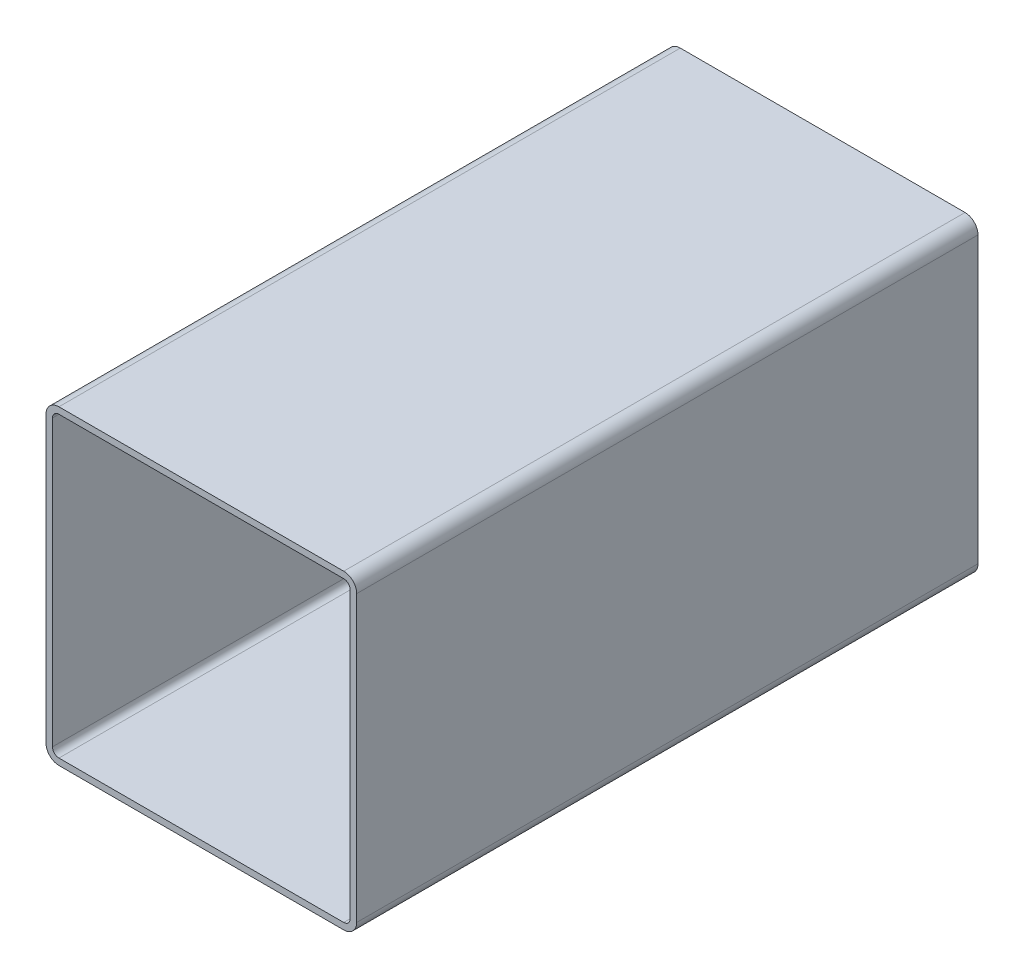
ISO-10303-21;
HEADER;
FILE_DESCRIPTION(('STEP AP214'),'2;1');
FILE_NAME('part.step','',(''),(''),'','','');
FILE_SCHEMA(('AUTOMOTIVE_DESIGN { 1 0 10303 214 1 1 1 1 }'));
ENDSEC;
DATA;
#1=APPLICATION_CONTEXT('core data for automotive mechanical design processes');
#2=APPLICATION_PROTOCOL_DEFINITION('international standard','automotive_design',2000,#1);
#3=PRODUCT_CONTEXT('',#1,'mechanical');
#4=PRODUCT('Part','Part','',(#3));
#5=PRODUCT_RELATED_PRODUCT_CATEGORY('part','',(#4));
#6=PRODUCT_DEFINITION_FORMATION('','',#4);
#7=PRODUCT_DEFINITION_CONTEXT('part definition',#1,'design');
#8=PRODUCT_DEFINITION('design','',#6,#7);
#9=PRODUCT_DEFINITION_SHAPE('','',#8);
#10=(LENGTH_UNIT() NAMED_UNIT(*) SI_UNIT(.MILLI.,.METRE.));
#11=(NAMED_UNIT(*) PLANE_ANGLE_UNIT() SI_UNIT($,.RADIAN.));
#12=(NAMED_UNIT(*) SI_UNIT($,.STERADIAN.) SOLID_ANGLE_UNIT());
#13=UNCERTAINTY_MEASURE_WITH_UNIT(LENGTH_MEASURE(1.E-05),#10,'distance_accuracy_value','');
#14=(GEOMETRIC_REPRESENTATION_CONTEXT(3) GLOBAL_UNCERTAINTY_ASSIGNED_CONTEXT((#13)) GLOBAL_UNIT_ASSIGNED_CONTEXT((#10,
#11,#12)) REPRESENTATION_CONTEXT('',''));
#15=CARTESIAN_POINT('',(0.,0.,0.));
#16=DIRECTION('',(0.,0.,1.));
#17=DIRECTION('',(1.,0.,0.));
#18=AXIS2_PLACEMENT_3D('',#15,#16,#17);
#19=CARTESIAN_POINT('',(6.39730139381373,148.061948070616,304.8));
#20=DIRECTION('',(0.,0.,1.));
#21=DIRECTION('',(1.,0.,0.));
#22=AXIS2_PLACEMENT_3D('',#19,#20,#21);
#23=PLANE('',#22);
#24=CARTESIAN_POINT('',(6.39730139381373,148.061948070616,304.8));
#25=DIRECTION('',(0.,0.,1.));
#26=DIRECTION('',(1.,0.,0.));
#27=AXIS2_PLACEMENT_3D('',#24,#25,#26);
#28=CIRCLE('',#27,6.35);
#29=CARTESIAN_POINT('',(6.39730139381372,154.411948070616,304.8));
#30=VERTEX_POINT('',#29);
#31=CARTESIAN_POINT('',(0.0473013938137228,148.061948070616,304.8));
#32=VERTEX_POINT('',#31);
#33=EDGE_CURVE('E211',#30,#32,#28,.T.);
#34=ORIENTED_EDGE('',*,*,#33,.T.);
#35=DIRECTION('',(0.,-1.,0.));
#36=VECTOR('',#35,1.);
#37=CARTESIAN_POINT('',(0.0473013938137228,8.36194807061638,304.8));
#38=LINE('',#37,#36);
#39=CARTESIAN_POINT('',(0.0473013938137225,8.36194807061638,304.8));
#40=VERTEX_POINT('',#39);
#41=EDGE_CURVE('E214',#32,#40,#38,.T.);
#42=ORIENTED_EDGE('',*,*,#41,.T.);
#43=CARTESIAN_POINT('',(6.39730139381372,8.36194807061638,304.8));
#44=DIRECTION('',(0.,0.,1.));
#45=DIRECTION('',(1.,0.,0.));
#46=AXIS2_PLACEMENT_3D('',#43,#44,#45);
#47=CIRCLE('',#46,6.35);
#48=CARTESIAN_POINT('',(6.39730139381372,2.01194807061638,304.8));
#49=VERTEX_POINT('',#48);
#50=EDGE_CURVE('E217',#40,#49,#47,.T.);
#51=ORIENTED_EDGE('',*,*,#50,.T.);
#52=DIRECTION('',(1.,0.,0.));
#53=VECTOR('',#52,1.);
#54=CARTESIAN_POINT('',(146.097301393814,2.01194807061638,304.8));
#55=LINE('',#54,#53);
#56=CARTESIAN_POINT('',(146.097301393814,2.01194807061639,304.8));
#57=VERTEX_POINT('',#56);
#58=EDGE_CURVE('E219',#49,#57,#55,.T.);
#59=ORIENTED_EDGE('',*,*,#58,.T.);
#60=CARTESIAN_POINT('',(146.097301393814,8.36194807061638,304.8));
#61=DIRECTION('',(0.,0.,1.));
#62=DIRECTION('',(1.,0.,0.));
#63=AXIS2_PLACEMENT_3D('',#60,#61,#62);
#64=CIRCLE('',#63,6.35);
#65=CARTESIAN_POINT('',(152.447301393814,8.36194807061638,304.8));
#66=VERTEX_POINT('',#65);
#67=EDGE_CURVE('E221',#57,#66,#64,.T.);
#68=ORIENTED_EDGE('',*,*,#67,.T.);
#69=DIRECTION('',(0.,1.,0.));
#70=VECTOR('',#69,1.);
#71=CARTESIAN_POINT('',(152.447301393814,148.061948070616,304.8));
#72=LINE('',#71,#70);
#73=CARTESIAN_POINT('',(152.447301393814,148.061948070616,304.8));
#74=VERTEX_POINT('',#73);
#75=EDGE_CURVE('E223',#66,#74,#72,.T.);
#76=ORIENTED_EDGE('',*,*,#75,.T.);
#77=CARTESIAN_POINT('',(146.097301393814,148.061948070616,304.8));
#78=DIRECTION('',(0.,0.,1.));
#79=DIRECTION('',(1.,0.,0.));
#80=AXIS2_PLACEMENT_3D('',#77,#78,#79);
#81=CIRCLE('',#80,6.34999999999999);
#82=CARTESIAN_POINT('',(146.097301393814,154.411948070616,304.8));
#83=VERTEX_POINT('',#82);
#84=EDGE_CURVE('E225',#74,#83,#81,.T.);
#85=ORIENTED_EDGE('',*,*,#84,.T.);
#86=DIRECTION('',(-1.,0.,0.));
#87=VECTOR('',#86,1.);
#88=CARTESIAN_POINT('',(6.39730139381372,154.411948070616,304.8));
#89=LINE('',#88,#87);
#90=EDGE_CURVE('E227',#83,#30,#89,.T.);
#91=ORIENTED_EDGE('',*,*,#90,.T.);
#92=EDGE_LOOP('',(#34,#42,#51,#59,#68,#76,#85,#91));
#93=FACE_BOUND('',#92,.T.);
#94=DIRECTION('',(0.,-1.,0.));
#95=VECTOR('',#94,1.);
#96=CARTESIAN_POINT('',(3.22230139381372,8.36194807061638,304.8));
#97=LINE('',#96,#95);
#98=CARTESIAN_POINT('',(3.22230139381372,148.061948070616,304.8));
#99=VERTEX_POINT('',#98);
#100=CARTESIAN_POINT('',(3.22230139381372,8.36194807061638,304.8));
#101=VERTEX_POINT('',#100);
#102=EDGE_CURVE('E154',#99,#101,#97,.T.);
#103=ORIENTED_EDGE('',*,*,#102,.F.);
#104=CARTESIAN_POINT('',(6.39730139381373,148.061948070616,304.8));
#105=DIRECTION('',(0.,0.,1.));
#106=DIRECTION('',(1.,0.,0.));
#107=AXIS2_PLACEMENT_3D('',#104,#105,#106);
#108=CIRCLE('',#107,3.17500000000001);
#109=CARTESIAN_POINT('',(6.39730139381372,151.236948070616,304.8));
#110=VERTEX_POINT('',#109);
#111=EDGE_CURVE('E146',#110,#99,#108,.T.);
#112=ORIENTED_EDGE('',*,*,#111,.F.);
#113=DIRECTION('',(-1.,0.,0.));
#114=VECTOR('',#113,1.);
#115=CARTESIAN_POINT('',(6.39730139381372,151.236948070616,304.8));
#116=LINE('',#115,#114);
#117=CARTESIAN_POINT('',(146.097301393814,151.236948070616,304.8));
#118=VERTEX_POINT('',#117);
#119=EDGE_CURVE('E179',#118,#110,#116,.T.);
#120=ORIENTED_EDGE('',*,*,#119,.F.);
#121=CARTESIAN_POINT('',(146.097301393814,148.061948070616,304.8));
#122=DIRECTION('',(0.,0.,1.));
#123=DIRECTION('',(1.,0.,0.));
#124=AXIS2_PLACEMENT_3D('',#121,#122,#123);
#125=CIRCLE('',#124,3.17500000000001);
#126=CARTESIAN_POINT('',(149.272301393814,148.061948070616,304.8));
#127=VERTEX_POINT('',#126);
#128=EDGE_CURVE('E177',#127,#118,#125,.T.);
#129=ORIENTED_EDGE('',*,*,#128,.F.);
#130=DIRECTION('',(0.,1.,0.));
#131=VECTOR('',#130,1.);
#132=CARTESIAN_POINT('',(149.272301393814,148.061948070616,304.8));
#133=LINE('',#132,#131);
#134=CARTESIAN_POINT('',(149.272301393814,8.36194807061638,304.8));
#135=VERTEX_POINT('',#134);
#136=EDGE_CURVE('E175',#135,#127,#133,.T.);
#137=ORIENTED_EDGE('',*,*,#136,.F.);
#138=CARTESIAN_POINT('',(146.097301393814,8.36194807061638,304.8));
#139=DIRECTION('',(0.,0.,1.));
#140=DIRECTION('',(1.,0.,0.));
#141=AXIS2_PLACEMENT_3D('',#138,#139,#140);
#142=CIRCLE('',#141,3.17500000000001);
#143=CARTESIAN_POINT('',(146.097301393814,5.18694807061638,304.8));
#144=VERTEX_POINT('',#143);
#145=EDGE_CURVE('E173',#144,#135,#142,.T.);
#146=ORIENTED_EDGE('',*,*,#145,.F.);
#147=DIRECTION('',(1.,0.,0.));
#148=VECTOR('',#147,1.);
#149=CARTESIAN_POINT('',(146.097301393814,5.18694807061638,304.8));
#150=LINE('',#149,#148);
#151=CARTESIAN_POINT('',(6.39730139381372,5.18694807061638,304.8));
#152=VERTEX_POINT('',#151);
#153=EDGE_CURVE('E169',#152,#144,#150,.T.);
#154=ORIENTED_EDGE('',*,*,#153,.F.);
#155=CARTESIAN_POINT('',(6.39730139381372,8.36194807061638,304.8));
#156=DIRECTION('',(0.,0.,1.));
#157=DIRECTION('',(1.,0.,0.));
#158=AXIS2_PLACEMENT_3D('',#155,#156,#157);
#159=CIRCLE('',#158,3.175);
#160=EDGE_CURVE('E167',#101,#152,#159,.T.);
#161=ORIENTED_EDGE('',*,*,#160,.F.);
#162=EDGE_LOOP('',(#103,#112,#120,#129,#137,#146,#154,#161));
#163=FACE_BOUND('',#162,.T.);
#164=ADVANCED_FACE('F33',(#93,#163),#23,.T.);
#165=CARTESIAN_POINT('',(6.39730139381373,148.061948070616,0.));
#166=DIRECTION('',(0.,0.,1.));
#167=DIRECTION('',(1.,0.,0.));
#168=AXIS2_PLACEMENT_3D('',#165,#166,#167);
#169=PLANE('',#168);
#170=CARTESIAN_POINT('',(6.39730139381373,148.061948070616,0.));
#171=DIRECTION('',(0.,0.,1.));
#172=DIRECTION('',(1.,0.,0.));
#173=AXIS2_PLACEMENT_3D('',#170,#171,#172);
#174=CIRCLE('',#173,6.35);
#175=CARTESIAN_POINT('',(6.39730139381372,154.411948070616,0.));
#176=VERTEX_POINT('',#175);
#177=CARTESIAN_POINT('',(0.0473013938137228,148.061948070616,0.));
#178=VERTEX_POINT('',#177);
#179=EDGE_CURVE('E162',#176,#178,#174,.T.);
#180=ORIENTED_EDGE('',*,*,#179,.F.);
#181=DIRECTION('',(-1.,0.,0.));
#182=VECTOR('',#181,1.);
#183=CARTESIAN_POINT('',(6.39730139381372,154.411948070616,0.));
#184=LINE('',#183,#182);
#185=CARTESIAN_POINT('',(146.097301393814,154.411948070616,0.));
#186=VERTEX_POINT('',#185);
#187=EDGE_CURVE('E215',#186,#176,#184,.T.);
#188=ORIENTED_EDGE('',*,*,#187,.F.);
#189=CARTESIAN_POINT('',(146.097301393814,148.061948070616,0.));
#190=DIRECTION('',(0.,0.,1.));
#191=DIRECTION('',(1.,0.,0.));
#192=AXIS2_PLACEMENT_3D('',#189,#190,#191);
#193=CIRCLE('',#192,6.34999999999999);
#194=CARTESIAN_POINT('',(152.447301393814,148.061948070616,0.));
#195=VERTEX_POINT('',#194);
#196=EDGE_CURVE('E242',#195,#186,#193,.T.);
#197=ORIENTED_EDGE('',*,*,#196,.F.);
#198=DIRECTION('',(0.,1.,0.));
#199=VECTOR('',#198,1.);
#200=CARTESIAN_POINT('',(152.447301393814,148.061948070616,0.));
#201=LINE('',#200,#199);
#202=CARTESIAN_POINT('',(152.447301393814,8.36194807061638,0.));
#203=VERTEX_POINT('',#202);
#204=EDGE_CURVE('E240',#203,#195,#201,.T.);
#205=ORIENTED_EDGE('',*,*,#204,.F.);
#206=CARTESIAN_POINT('',(146.097301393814,8.36194807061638,0.));
#207=DIRECTION('',(0.,0.,1.));
#208=DIRECTION('',(1.,0.,0.));
#209=AXIS2_PLACEMENT_3D('',#206,#207,#208);
#210=CIRCLE('',#209,6.35);
#211=CARTESIAN_POINT('',(146.097301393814,2.01194807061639,0.));
#212=VERTEX_POINT('',#211);
#213=EDGE_CURVE('E238',#212,#203,#210,.T.);
#214=ORIENTED_EDGE('',*,*,#213,.F.);
#215=DIRECTION('',(1.,0.,0.));
#216=VECTOR('',#215,1.);
#217=CARTESIAN_POINT('',(146.097301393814,2.01194807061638,0.));
#218=LINE('',#217,#216);
#219=CARTESIAN_POINT('',(6.39730139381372,2.01194807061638,0.));
#220=VERTEX_POINT('',#219);
#221=EDGE_CURVE('E236',#220,#212,#218,.T.);
#222=ORIENTED_EDGE('',*,*,#221,.F.);
#223=CARTESIAN_POINT('',(6.39730139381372,8.36194807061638,0.));
#224=DIRECTION('',(0.,0.,1.));
#225=DIRECTION('',(1.,0.,0.));
#226=AXIS2_PLACEMENT_3D('',#223,#224,#225);
#227=CIRCLE('',#226,6.35);
#228=CARTESIAN_POINT('',(0.0473013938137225,8.36194807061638,0.));
#229=VERTEX_POINT('',#228);
#230=EDGE_CURVE('E234',#229,#220,#227,.T.);
#231=ORIENTED_EDGE('',*,*,#230,.F.);
#232=DIRECTION('',(0.,-1.,0.));
#233=VECTOR('',#232,1.);
#234=CARTESIAN_POINT('',(0.0473013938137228,8.36194807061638,0.));
#235=LINE('',#234,#233);
#236=EDGE_CURVE('E232',#178,#229,#235,.T.);
#237=ORIENTED_EDGE('',*,*,#236,.F.);
#238=EDGE_LOOP('',(#180,#188,#197,#205,#214,#222,#231,#237));
#239=FACE_BOUND('',#238,.T.);
#240=CARTESIAN_POINT('',(6.39730139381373,148.061948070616,0.));
#241=DIRECTION('',(0.,0.,1.));
#242=DIRECTION('',(1.,0.,0.));
#243=AXIS2_PLACEMENT_3D('',#240,#241,#242);
#244=CIRCLE('',#243,3.17500000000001);
#245=CARTESIAN_POINT('',(6.39730139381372,151.236948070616,0.));
#246=VERTEX_POINT('',#245);
#247=CARTESIAN_POINT('',(3.22230139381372,148.061948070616,0.));
#248=VERTEX_POINT('',#247);
#249=EDGE_CURVE('E56',#246,#248,#244,.T.);
#250=ORIENTED_EDGE('',*,*,#249,.T.);
#251=DIRECTION('',(0.,-1.,0.));
#252=VECTOR('',#251,1.);
#253=CARTESIAN_POINT('',(3.22230139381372,8.36194807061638,0.));
#254=LINE('',#253,#252);
#255=CARTESIAN_POINT('',(3.22230139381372,8.36194807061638,0.));
#256=VERTEX_POINT('',#255);
#257=EDGE_CURVE('E161',#248,#256,#254,.T.);
#258=ORIENTED_EDGE('',*,*,#257,.T.);
#259=CARTESIAN_POINT('',(6.39730139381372,8.36194807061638,0.));
#260=DIRECTION('',(0.,0.,1.));
#261=DIRECTION('',(1.,0.,0.));
#262=AXIS2_PLACEMENT_3D('',#259,#260,#261);
#263=CIRCLE('',#262,3.175);
#264=CARTESIAN_POINT('',(6.39730139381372,5.18694807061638,0.));
#265=VERTEX_POINT('',#264);
#266=EDGE_CURVE('E183',#256,#265,#263,.T.);
#267=ORIENTED_EDGE('',*,*,#266,.T.);
#268=DIRECTION('',(1.,0.,0.));
#269=VECTOR('',#268,1.);
#270=CARTESIAN_POINT('',(146.097301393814,5.18694807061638,0.));
#271=LINE('',#270,#269);
#272=CARTESIAN_POINT('',(146.097301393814,5.18694807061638,0.));
#273=VERTEX_POINT('',#272);
#274=EDGE_CURVE('E186',#265,#273,#271,.T.);
#275=ORIENTED_EDGE('',*,*,#274,.T.);
#276=CARTESIAN_POINT('',(146.097301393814,8.36194807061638,0.));
#277=DIRECTION('',(0.,0.,1.));
#278=DIRECTION('',(1.,0.,0.));
#279=AXIS2_PLACEMENT_3D('',#276,#277,#278);
#280=CIRCLE('',#279,3.17500000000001);
#281=CARTESIAN_POINT('',(149.272301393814,8.36194807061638,0.));
#282=VERTEX_POINT('',#281);
#283=EDGE_CURVE('E189',#273,#282,#280,.T.);
#284=ORIENTED_EDGE('',*,*,#283,.T.);
#285=DIRECTION('',(0.,1.,0.));
#286=VECTOR('',#285,1.);
#287=CARTESIAN_POINT('',(149.272301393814,148.061948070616,0.));
#288=LINE('',#287,#286);
#289=CARTESIAN_POINT('',(149.272301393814,148.061948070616,0.));
#290=VERTEX_POINT('',#289);
#291=EDGE_CURVE('E192',#282,#290,#288,.T.);
#292=ORIENTED_EDGE('',*,*,#291,.T.);
#293=CARTESIAN_POINT('',(146.097301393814,148.061948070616,0.));
#294=DIRECTION('',(0.,0.,1.));
#295=DIRECTION('',(1.,0.,0.));
#296=AXIS2_PLACEMENT_3D('',#293,#294,#295);
#297=CIRCLE('',#296,3.17500000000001);
#298=CARTESIAN_POINT('',(146.097301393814,151.236948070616,0.));
#299=VERTEX_POINT('',#298);
#300=EDGE_CURVE('E195',#290,#299,#297,.T.);
#301=ORIENTED_EDGE('',*,*,#300,.T.);
#302=DIRECTION('',(-1.,0.,0.));
#303=VECTOR('',#302,1.);
#304=CARTESIAN_POINT('',(6.39730139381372,151.236948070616,0.));
#305=LINE('',#304,#303);
#306=EDGE_CURVE('E155',#299,#246,#305,.T.);
#307=ORIENTED_EDGE('',*,*,#306,.T.);
#308=EDGE_LOOP('',(#250,#258,#267,#275,#284,#292,#301,#307));
#309=FACE_BOUND('',#308,.T.);
#310=ADVANCED_FACE('F272',(#239,#309),#169,.F.);
#311=CARTESIAN_POINT('',(6.39730139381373,148.061948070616,304.8));
#312=DIRECTION('',(0.,0.,-1.));
#313=DIRECTION('',(-1.,0.,0.));
#314=AXIS2_PLACEMENT_3D('',#311,#312,#313);
#315=CYLINDRICAL_SURFACE('',#314,6.35);
#316=ORIENTED_EDGE('',*,*,#179,.T.);
#317=DIRECTION('',(0.,0.,-1.));
#318=VECTOR('',#317,1.);
#319=CARTESIAN_POINT('',(0.0473013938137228,148.061948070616,304.8));
#320=LINE('',#319,#318);
#321=EDGE_CURVE('E11',#32,#178,#320,.T.);
#322=ORIENTED_EDGE('',*,*,#321,.F.);
#323=ORIENTED_EDGE('',*,*,#33,.F.);
#324=DIRECTION('',(0.,0.,-1.));
#325=VECTOR('',#324,1.);
#326=CARTESIAN_POINT('',(6.39730139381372,154.411948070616,304.8));
#327=LINE('',#326,#325);
#328=EDGE_CURVE('E229',#30,#176,#327,.T.);
#329=ORIENTED_EDGE('',*,*,#328,.T.);
#330=EDGE_LOOP('',(#316,#322,#323,#329));
#331=FACE_BOUND('',#330,.T.);
#332=ADVANCED_FACE('F35',(#331),#315,.T.);
#333=CARTESIAN_POINT('',(0.0473013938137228,8.36194807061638,304.8));
#334=DIRECTION('',(1.,0.,0.));
#335=DIRECTION('',(0.,0.,-1.));
#336=AXIS2_PLACEMENT_3D('',#333,#334,#335);
#337=PLANE('',#336);
#338=ORIENTED_EDGE('',*,*,#236,.T.);
#339=DIRECTION('',(0.,0.,-1.));
#340=VECTOR('',#339,1.);
#341=CARTESIAN_POINT('',(0.0473013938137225,8.36194807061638,304.8));
#342=LINE('',#341,#340);
#343=EDGE_CURVE('E41',#40,#229,#342,.T.);
#344=ORIENTED_EDGE('',*,*,#343,.F.);
#345=ORIENTED_EDGE('',*,*,#41,.F.);
#346=ORIENTED_EDGE('',*,*,#321,.T.);
#347=EDGE_LOOP('',(#338,#344,#345,#346));
#348=FACE_BOUND('',#347,.T.);
#349=ADVANCED_FACE('F289',(#348),#337,.F.);
#350=CARTESIAN_POINT('',(6.39730139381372,8.36194807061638,304.8));
#351=DIRECTION('',(0.,0.,-1.));
#352=DIRECTION('',(-1.,0.,0.));
#353=AXIS2_PLACEMENT_3D('',#350,#351,#352);
#354=CYLINDRICAL_SURFACE('',#353,6.35);
#355=ORIENTED_EDGE('',*,*,#230,.T.);
#356=DIRECTION('',(0.,0.,-1.));
#357=VECTOR('',#356,1.);
#358=CARTESIAN_POINT('',(6.39730139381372,2.01194807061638,304.8));
#359=LINE('',#358,#357);
#360=EDGE_CURVE('E259',#49,#220,#359,.T.);
#361=ORIENTED_EDGE('',*,*,#360,.F.);
#362=ORIENTED_EDGE('',*,*,#50,.F.);
#363=ORIENTED_EDGE('',*,*,#343,.T.);
#364=EDGE_LOOP('',(#355,#361,#362,#363));
#365=FACE_BOUND('',#364,.T.);
#366=ADVANCED_FACE('F266',(#365),#354,.T.);
#367=CARTESIAN_POINT('',(146.097301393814,2.01194807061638,304.8));
#368=DIRECTION('',(0.,1.,0.));
#369=DIRECTION('',(0.,0.,1.));
#370=AXIS2_PLACEMENT_3D('',#367,#368,#369);
#371=PLANE('',#370);
#372=ORIENTED_EDGE('',*,*,#221,.T.);
#373=DIRECTION('',(0.,0.,-1.));
#374=VECTOR('',#373,1.);
#375=CARTESIAN_POINT('',(146.097301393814,2.01194807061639,304.8));
#376=LINE('',#375,#374);
#377=EDGE_CURVE('E256',#57,#212,#376,.T.);
#378=ORIENTED_EDGE('',*,*,#377,.F.);
#379=ORIENTED_EDGE('',*,*,#58,.F.);
#380=ORIENTED_EDGE('',*,*,#360,.T.);
#381=EDGE_LOOP('',(#372,#378,#379,#380));
#382=FACE_BOUND('',#381,.T.);
#383=ADVANCED_FACE('F278',(#382),#371,.F.);
#384=CARTESIAN_POINT('',(146.097301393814,8.36194807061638,304.8));
#385=DIRECTION('',(0.,0.,-1.));
#386=DIRECTION('',(-1.,0.,0.));
#387=AXIS2_PLACEMENT_3D('',#384,#385,#386);
#388=CYLINDRICAL_SURFACE('',#387,6.35);
#389=ORIENTED_EDGE('',*,*,#213,.T.);
#390=DIRECTION('',(0.,0.,-1.));
#391=VECTOR('',#390,1.);
#392=CARTESIAN_POINT('',(152.447301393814,8.36194807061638,304.8));
#393=LINE('',#392,#391);
#394=EDGE_CURVE('E253',#66,#203,#393,.T.);
#395=ORIENTED_EDGE('',*,*,#394,.F.);
#396=ORIENTED_EDGE('',*,*,#67,.F.);
#397=ORIENTED_EDGE('',*,*,#377,.T.);
#398=EDGE_LOOP('',(#389,#395,#396,#397));
#399=FACE_BOUND('',#398,.T.);
#400=ADVANCED_FACE('F282',(#399),#388,.T.);
#401=CARTESIAN_POINT('',(152.447301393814,148.061948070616,304.8));
#402=DIRECTION('',(-1.,0.,0.));
#403=DIRECTION('',(0.,0.,1.));
#404=AXIS2_PLACEMENT_3D('',#401,#402,#403);
#405=PLANE('',#404);
#406=ORIENTED_EDGE('',*,*,#204,.T.);
#407=DIRECTION('',(0.,0.,-1.));
#408=VECTOR('',#407,1.);
#409=CARTESIAN_POINT('',(152.447301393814,148.061948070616,304.8));
#410=LINE('',#409,#408);
#411=EDGE_CURVE('E250',#74,#195,#410,.T.);
#412=ORIENTED_EDGE('',*,*,#411,.F.);
#413=ORIENTED_EDGE('',*,*,#75,.F.);
#414=ORIENTED_EDGE('',*,*,#394,.T.);
#415=EDGE_LOOP('',(#406,#412,#413,#414));
#416=FACE_BOUND('',#415,.T.);
#417=ADVANCED_FACE('F302',(#416),#405,.F.);
#418=CARTESIAN_POINT('',(146.097301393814,148.061948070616,304.8));
#419=DIRECTION('',(0.,0.,-1.));
#420=DIRECTION('',(-1.,0.,0.));
#421=AXIS2_PLACEMENT_3D('',#418,#419,#420);
#422=CYLINDRICAL_SURFACE('',#421,6.34999999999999);
#423=ORIENTED_EDGE('',*,*,#196,.T.);
#424=DIRECTION('',(0.,0.,-1.));
#425=VECTOR('',#424,1.);
#426=CARTESIAN_POINT('',(146.097301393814,154.411948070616,304.8));
#427=LINE('',#426,#425);
#428=EDGE_CURVE('E247',#83,#186,#427,.T.);
#429=ORIENTED_EDGE('',*,*,#428,.F.);
#430=ORIENTED_EDGE('',*,*,#84,.F.);
#431=ORIENTED_EDGE('',*,*,#411,.T.);
#432=EDGE_LOOP('',(#423,#429,#430,#431));
#433=FACE_BOUND('',#432,.T.);
#434=ADVANCED_FACE('F300',(#433),#422,.T.);
#435=CARTESIAN_POINT('',(6.39730139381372,154.411948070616,304.8));
#436=DIRECTION('',(0.,-1.,0.));
#437=DIRECTION('',(0.,0.,-1.));
#438=AXIS2_PLACEMENT_3D('',#435,#436,#437);
#439=PLANE('',#438);
#440=ORIENTED_EDGE('',*,*,#187,.T.);
#441=ORIENTED_EDGE('',*,*,#328,.F.);
#442=ORIENTED_EDGE('',*,*,#90,.F.);
#443=ORIENTED_EDGE('',*,*,#428,.T.);
#444=EDGE_LOOP('',(#440,#441,#442,#443));
#445=FACE_BOUND('',#444,.T.);
#446=ADVANCED_FACE('F295',(#445),#439,.F.);
#447=CARTESIAN_POINT('',(6.39730139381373,148.061948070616,304.8));
#448=DIRECTION('',(0.,0.,-1.));
#449=DIRECTION('',(-1.,0.,0.));
#450=AXIS2_PLACEMENT_3D('',#447,#448,#449);
#451=CYLINDRICAL_SURFACE('',#450,3.17500000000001);
#452=ORIENTED_EDGE('',*,*,#249,.F.);
#453=DIRECTION('',(0.,0.,-1.));
#454=VECTOR('',#453,1.);
#455=CARTESIAN_POINT('',(6.39730139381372,151.236948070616,304.8));
#456=LINE('',#455,#454);
#457=EDGE_CURVE('E150',#110,#246,#456,.T.);
#458=ORIENTED_EDGE('',*,*,#457,.F.);
#459=ORIENTED_EDGE('',*,*,#111,.T.);
#460=DIRECTION('',(0.,0.,-1.));
#461=VECTOR('',#460,1.);
#462=CARTESIAN_POINT('',(3.22230139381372,148.061948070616,304.8));
#463=LINE('',#462,#461);
#464=EDGE_CURVE('E149',#99,#248,#463,.T.);
#465=ORIENTED_EDGE('',*,*,#464,.T.);
#466=EDGE_LOOP('',(#452,#458,#459,#465));
#467=FACE_BOUND('',#466,.T.);
#468=ADVANCED_FACE('F148',(#467),#451,.F.);
#469=CARTESIAN_POINT('',(3.22230139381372,8.36194807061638,304.8));
#470=DIRECTION('',(1.,0.,0.));
#471=DIRECTION('',(0.,0.,-1.));
#472=AXIS2_PLACEMENT_3D('',#469,#470,#471);
#473=PLANE('',#472);
#474=ORIENTED_EDGE('',*,*,#257,.F.);
#475=ORIENTED_EDGE('',*,*,#464,.F.);
#476=ORIENTED_EDGE('',*,*,#102,.T.);
#477=DIRECTION('',(0.,0.,-1.));
#478=VECTOR('',#477,1.);
#479=CARTESIAN_POINT('',(3.22230139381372,8.36194807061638,304.8));
#480=LINE('',#479,#478);
#481=EDGE_CURVE('E163',#101,#256,#480,.T.);
#482=ORIENTED_EDGE('',*,*,#481,.T.);
#483=EDGE_LOOP('',(#474,#475,#476,#482));
#484=FACE_BOUND('',#483,.T.);
#485=ADVANCED_FACE('F158',(#484),#473,.T.);
#486=CARTESIAN_POINT('',(6.39730139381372,8.36194807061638,304.8));
#487=DIRECTION('',(0.,0.,-1.));
#488=DIRECTION('',(-1.,0.,0.));
#489=AXIS2_PLACEMENT_3D('',#486,#487,#488);
#490=CYLINDRICAL_SURFACE('',#489,3.175);
#491=ORIENTED_EDGE('',*,*,#266,.F.);
#492=ORIENTED_EDGE('',*,*,#481,.F.);
#493=ORIENTED_EDGE('',*,*,#160,.T.);
#494=DIRECTION('',(0.,0.,-1.));
#495=VECTOR('',#494,1.);
#496=CARTESIAN_POINT('',(6.39730139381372,5.18694807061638,304.8));
#497=LINE('',#496,#495);
#498=EDGE_CURVE('E208',#152,#265,#497,.T.);
#499=ORIENTED_EDGE('',*,*,#498,.T.);
#500=EDGE_LOOP('',(#491,#492,#493,#499));
#501=FACE_BOUND('',#500,.T.);
#502=ADVANCED_FACE('F327',(#501),#490,.F.);
#503=CARTESIAN_POINT('',(146.097301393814,5.18694807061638,304.8));
#504=DIRECTION('',(0.,1.,0.));
#505=DIRECTION('',(0.,0.,1.));
#506=AXIS2_PLACEMENT_3D('',#503,#504,#505);
#507=PLANE('',#506);
#508=ORIENTED_EDGE('',*,*,#274,.F.);
#509=ORIENTED_EDGE('',*,*,#498,.F.);
#510=ORIENTED_EDGE('',*,*,#153,.T.);
#511=DIRECTION('',(0.,0.,-1.));
#512=VECTOR('',#511,1.);
#513=CARTESIAN_POINT('',(146.097301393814,5.18694807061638,304.8));
#514=LINE('',#513,#512);
#515=EDGE_CURVE('E206',#144,#273,#514,.T.);
#516=ORIENTED_EDGE('',*,*,#515,.T.);
#517=EDGE_LOOP('',(#508,#509,#510,#516));
#518=FACE_BOUND('',#517,.T.);
#519=ADVANCED_FACE('F331',(#518),#507,.T.);
#520=CARTESIAN_POINT('',(146.097301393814,8.36194807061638,304.8));
#521=DIRECTION('',(0.,0.,-1.));
#522=DIRECTION('',(-1.,0.,0.));
#523=AXIS2_PLACEMENT_3D('',#520,#521,#522);
#524=CYLINDRICAL_SURFACE('',#523,3.17500000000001);
#525=ORIENTED_EDGE('',*,*,#283,.F.);
#526=ORIENTED_EDGE('',*,*,#515,.F.);
#527=ORIENTED_EDGE('',*,*,#145,.T.);
#528=DIRECTION('',(0.,0.,-1.));
#529=VECTOR('',#528,1.);
#530=CARTESIAN_POINT('',(149.272301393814,8.36194807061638,304.8));
#531=LINE('',#530,#529);
#532=EDGE_CURVE('E204',#135,#282,#531,.T.);
#533=ORIENTED_EDGE('',*,*,#532,.T.);
#534=EDGE_LOOP('',(#525,#526,#527,#533));
#535=FACE_BOUND('',#534,.T.);
#536=ADVANCED_FACE('F337',(#535),#524,.F.);
#537=CARTESIAN_POINT('',(149.272301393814,148.061948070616,304.8));
#538=DIRECTION('',(-1.,0.,0.));
#539=DIRECTION('',(0.,0.,1.));
#540=AXIS2_PLACEMENT_3D('',#537,#538,#539);
#541=PLANE('',#540);
#542=ORIENTED_EDGE('',*,*,#291,.F.);
#543=ORIENTED_EDGE('',*,*,#532,.F.);
#544=ORIENTED_EDGE('',*,*,#136,.T.);
#545=DIRECTION('',(0.,0.,-1.));
#546=VECTOR('',#545,1.);
#547=CARTESIAN_POINT('',(149.272301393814,148.061948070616,304.8));
#548=LINE('',#547,#546);
#549=EDGE_CURVE('E202',#127,#290,#548,.T.);
#550=ORIENTED_EDGE('',*,*,#549,.T.);
#551=EDGE_LOOP('',(#542,#543,#544,#550));
#552=FACE_BOUND('',#551,.T.);
#553=ADVANCED_FACE('F341',(#552),#541,.T.);
#554=CARTESIAN_POINT('',(146.097301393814,148.061948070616,304.8));
#555=DIRECTION('',(0.,0.,-1.));
#556=DIRECTION('',(-1.,0.,0.));
#557=AXIS2_PLACEMENT_3D('',#554,#555,#556);
#558=CYLINDRICAL_SURFACE('',#557,3.17500000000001);
#559=ORIENTED_EDGE('',*,*,#300,.F.);
#560=ORIENTED_EDGE('',*,*,#549,.F.);
#561=ORIENTED_EDGE('',*,*,#128,.T.);
#562=DIRECTION('',(0.,0.,-1.));
#563=VECTOR('',#562,1.);
#564=CARTESIAN_POINT('',(146.097301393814,151.236948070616,304.8));
#565=LINE('',#564,#563);
#566=EDGE_CURVE('E48',#118,#299,#565,.T.);
#567=ORIENTED_EDGE('',*,*,#566,.T.);
#568=EDGE_LOOP('',(#559,#560,#561,#567));
#569=FACE_BOUND('',#568,.T.);
#570=ADVANCED_FACE('F345',(#569),#558,.F.);
#571=CARTESIAN_POINT('',(6.39730139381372,151.236948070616,304.8));
#572=DIRECTION('',(0.,-1.,0.));
#573=DIRECTION('',(0.,0.,-1.));
#574=AXIS2_PLACEMENT_3D('',#571,#572,#573);
#575=PLANE('',#574);
#576=ORIENTED_EDGE('',*,*,#306,.F.);
#577=ORIENTED_EDGE('',*,*,#566,.F.);
#578=ORIENTED_EDGE('',*,*,#119,.T.);
#579=ORIENTED_EDGE('',*,*,#457,.T.);
#580=EDGE_LOOP('',(#576,#577,#578,#579));
#581=FACE_BOUND('',#580,.T.);
#582=ADVANCED_FACE('F349',(#581),#575,.T.);
#583=CLOSED_SHELL('',(#164,#310,#332,#349,#366,#383,#400,#417,#434,#446,#468,#485,#502,#519,
#536,#553,#570,#582));
#584=MANIFOLD_SOLID_BREP('B2',#583);
#585=ADVANCED_BREP_SHAPE_REPRESENTATION('',(#18,#584),#14);
#586=SHAPE_DEFINITION_REPRESENTATION(#9,#585);
ENDSEC;
END-ISO-10303-21;
